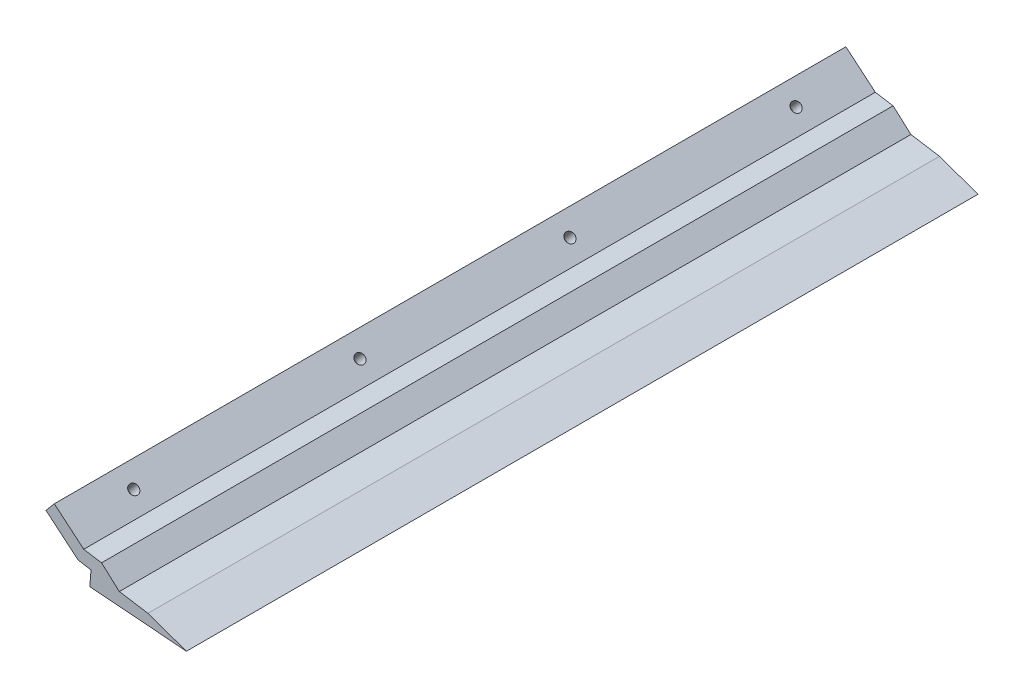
ISO-10303-21;
HEADER;
FILE_DESCRIPTION(('STEP AP214'),'2;1');
FILE_NAME('part.step','',(''),(''),'','','');
FILE_SCHEMA(('AUTOMOTIVE_DESIGN { 1 0 10303 214 1 1 1 1 }'));
ENDSEC;
DATA;
#1=APPLICATION_CONTEXT('core data for automotive mechanical design processes');
#2=APPLICATION_PROTOCOL_DEFINITION('international standard','automotive_design',2000,#1);
#3=PRODUCT_CONTEXT('',#1,'mechanical');
#4=PRODUCT('Part','Part','',(#3));
#5=PRODUCT_RELATED_PRODUCT_CATEGORY('part','',(#4));
#6=PRODUCT_DEFINITION_FORMATION('','',#4);
#7=PRODUCT_DEFINITION_CONTEXT('part definition',#1,'design');
#8=PRODUCT_DEFINITION('design','',#6,#7);
#9=PRODUCT_DEFINITION_SHAPE('','',#8);
#10=(LENGTH_UNIT() NAMED_UNIT(*) SI_UNIT(.MILLI.,.METRE.));
#11=(NAMED_UNIT(*) PLANE_ANGLE_UNIT() SI_UNIT($,.RADIAN.));
#12=(NAMED_UNIT(*) SI_UNIT($,.STERADIAN.) SOLID_ANGLE_UNIT());
#13=UNCERTAINTY_MEASURE_WITH_UNIT(LENGTH_MEASURE(1.E-05),#10,'distance_accuracy_value','');
#14=(GEOMETRIC_REPRESENTATION_CONTEXT(3) GLOBAL_UNCERTAINTY_ASSIGNED_CONTEXT((#13)) GLOBAL_UNIT_ASSIGNED_CONTEXT((#10,
#11,#12)) REPRESENTATION_CONTEXT('',''));
#15=CARTESIAN_POINT('',(0.,0.,0.));
#16=DIRECTION('',(0.,0.,1.));
#17=DIRECTION('',(1.,0.,0.));
#18=AXIS2_PLACEMENT_3D('',#15,#16,#17);
#19=CARTESIAN_POINT('',(0.,0.,245.));
#20=DIRECTION('',(0.,0.,-1.));
#21=DIRECTION('',(-1.,0.,0.));
#22=AXIS2_PLACEMENT_3D('',#19,#20,#21);
#23=PLANE('',#22);
#24=DIRECTION('',(0.0790333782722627,0.996871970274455,0.));
#25=VECTOR('',#24,1.);
#26=CARTESIAN_POINT('',(38.0749704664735,-3.01863592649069,245.));
#27=LINE('',#26,#25);
#28=CARTESIAN_POINT('',(38.5022683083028,2.37100134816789,245.));
#29=VERTEX_POINT('',#28);
#30=CARTESIAN_POINT('',(38.8721934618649,7.03697950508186,245.));
#31=VERTEX_POINT('',#30);
#32=EDGE_CURVE('E217',#29,#31,#27,.T.);
#33=ORIENTED_EDGE('',*,*,#32,.F.);
#34=DIRECTION('',(0.996871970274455,-0.079033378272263,0.));
#35=VECTOR('',#34,1.);
#36=CARTESIAN_POINT('',(32.9164336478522,2.81385398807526,245.));
#37=LINE('',#36,#35);
#38=CARTESIAN_POINT('',(68.4084274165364,0.,245.));
#39=VERTEX_POINT('',#38);
#40=EDGE_CURVE('E240',#29,#39,#37,.T.);
#41=ORIENTED_EDGE('',*,*,#40,.T.);
#42=DIRECTION('',(-0.942668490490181,0.333730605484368,0.));
#43=VECTOR('',#42,1.);
#44=CARTESIAN_POINT('',(56.5013619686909,4.21542907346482,245.));
#45=LINE('',#44,#43);
#46=CARTESIAN_POINT('',(56.5013619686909,4.21542907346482,245.));
#47=VERTEX_POINT('',#46);
#48=EDGE_CURVE('E227',#39,#47,#45,.T.);
#49=ORIENTED_EDGE('',*,*,#48,.T.);
#50=DIRECTION('',(-0.987432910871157,0.15803875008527,0.));
#51=VECTOR('',#50,1.);
#52=CARTESIAN_POINT('',(34.9055240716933,7.67184539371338,245.));
#53=LINE('',#52,#51);
#54=CARTESIAN_POINT('',(47.64506833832,5.63287987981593,245.));
#55=VERTEX_POINT('',#54);
#56=EDGE_CURVE('E228',#47,#55,#53,.T.);
#57=ORIENTED_EDGE('',*,*,#56,.T.);
#58=DIRECTION('',(-0.745290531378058,0.666739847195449,0.));
#59=VECTOR('',#58,1.);
#60=CARTESIAN_POINT('',(42.13028103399,10.5664303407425,245.));
#61=LINE('',#60,#59);
#62=CARTESIAN_POINT('',(42.13028103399,10.5664303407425,245.));
#63=VERTEX_POINT('',#62);
#64=EDGE_CURVE('E209',#55,#63,#61,.T.);
#65=ORIENTED_EDGE('',*,*,#64,.T.);
#66=DIRECTION('',(-0.987432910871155,0.158038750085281,0.));
#67=VECTOR('',#66,1.);
#68=CARTESIAN_POINT('',(36.629582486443,11.4468177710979,245.));
#69=LINE('',#68,#67);
#70=CARTESIAN_POINT('',(36.629582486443,11.4468177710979,245.));
#71=VERTEX_POINT('',#70);
#72=EDGE_CURVE('E210',#63,#71,#69,.T.);
#73=ORIENTED_EDGE('',*,*,#72,.T.);
#74=DIRECTION('',(-0.766044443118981,0.642787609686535,0.));
#75=VECTOR('',#74,1.);
#76=CARTESIAN_POINT('',(27.5180967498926,19.0922620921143,245.));
#77=LINE('',#76,#75);
#78=CARTESIAN_POINT('',(27.5180967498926,19.0922620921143,245.));
#79=VERTEX_POINT('',#78);
#80=EDGE_CURVE('E175',#71,#79,#77,.T.);
#81=ORIENTED_EDGE('',*,*,#80,.T.);
#82=DIRECTION('',(-0.642787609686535,-0.766044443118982,0.));
#83=VECTOR('',#82,1.);
#84=CARTESIAN_POINT('',(24.9469463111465,16.0280843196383,245.));
#85=LINE('',#84,#83);
#86=CARTESIAN_POINT('',(24.9469463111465,16.0280843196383,245.));
#87=VERTEX_POINT('',#86);
#88=EDGE_CURVE('E273',#79,#87,#85,.T.);
#89=ORIENTED_EDGE('',*,*,#88,.T.);
#90=DIRECTION('',(0.766044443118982,-0.642787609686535,0.));
#91=VECTOR('',#90,1.);
#92=CARTESIAN_POINT('',(34.9055240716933,7.67184539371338,245.));
#93=LINE('',#92,#91);
#94=CARTESIAN_POINT('',(34.9055240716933,7.67184539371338,245.));
#95=VERTEX_POINT('',#94);
#96=EDGE_CURVE('E268',#87,#95,#93,.T.);
#97=ORIENTED_EDGE('',*,*,#96,.T.);
#98=DIRECTION('',(0.987432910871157,-0.15803875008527,0.));
#99=VECTOR('',#98,1.);
#100=CARTESIAN_POINT('',(38.8721934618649,7.03697950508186,245.));
#101=LINE('',#100,#99);
#102=EDGE_CURVE('E258',#95,#31,#101,.T.);
#103=ORIENTED_EDGE('',*,*,#102,.T.);
#104=EDGE_LOOP('',(#33,#41,#49,#57,#65,#73,#81,#89,#97,#103));
#105=FACE_BOUND('',#104,.T.);
#106=ADVANCED_FACE('F91',(#105),#23,.F.);
#107=CARTESIAN_POINT('',(0.,0.,0.));
#108=DIRECTION('',(0.,0.,-1.));
#109=DIRECTION('',(-1.,0.,0.));
#110=AXIS2_PLACEMENT_3D('',#107,#108,#109);
#111=PLANE('',#110);
#112=DIRECTION('',(0.996871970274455,-0.079033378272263,0.));
#113=VECTOR('',#112,1.);
#114=CARTESIAN_POINT('',(32.9164336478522,2.81385398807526,0.));
#115=LINE('',#114,#113);
#116=CARTESIAN_POINT('',(38.5022683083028,2.37100134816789,0.));
#117=VERTEX_POINT('',#116);
#118=CARTESIAN_POINT('',(68.4084274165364,0.,0.));
#119=VERTEX_POINT('',#118);
#120=EDGE_CURVE('E238',#117,#119,#115,.T.);
#121=ORIENTED_EDGE('',*,*,#120,.F.);
#122=DIRECTION('',(0.0790333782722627,0.996871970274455,0.));
#123=VECTOR('',#122,1.);
#124=CARTESIAN_POINT('',(38.0749704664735,-3.01863592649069,0.));
#125=LINE('',#124,#123);
#126=CARTESIAN_POINT('',(38.8721934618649,7.03697950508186,0.));
#127=VERTEX_POINT('',#126);
#128=EDGE_CURVE('E213',#117,#127,#125,.T.);
#129=ORIENTED_EDGE('',*,*,#128,.T.);
#130=DIRECTION('',(-0.987432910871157,0.15803875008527,0.));
#131=VECTOR('',#130,1.);
#132=CARTESIAN_POINT('',(38.8721934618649,7.03697950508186,0.));
#133=LINE('',#132,#131);
#134=CARTESIAN_POINT('',(34.9055240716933,7.67184539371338,0.));
#135=VERTEX_POINT('',#134);
#136=EDGE_CURVE('E203',#127,#135,#133,.T.);
#137=ORIENTED_EDGE('',*,*,#136,.T.);
#138=DIRECTION('',(-0.766044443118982,0.642787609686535,0.));
#139=VECTOR('',#138,1.);
#140=CARTESIAN_POINT('',(34.9055240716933,7.67184539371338,0.));
#141=LINE('',#140,#139);
#142=CARTESIAN_POINT('',(24.9469463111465,16.0280843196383,0.));
#143=VERTEX_POINT('',#142);
#144=EDGE_CURVE('E206',#135,#143,#141,.T.);
#145=ORIENTED_EDGE('',*,*,#144,.T.);
#146=DIRECTION('',(0.642787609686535,0.766044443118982,0.));
#147=VECTOR('',#146,1.);
#148=CARTESIAN_POINT('',(24.9469463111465,16.0280843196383,0.));
#149=LINE('',#148,#147);
#150=CARTESIAN_POINT('',(27.5180967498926,19.0922620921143,0.));
#151=VERTEX_POINT('',#150);
#152=EDGE_CURVE('E193',#143,#151,#149,.T.);
#153=ORIENTED_EDGE('',*,*,#152,.T.);
#154=DIRECTION('',(0.766044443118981,-0.642787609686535,0.));
#155=VECTOR('',#154,1.);
#156=CARTESIAN_POINT('',(27.5180967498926,19.0922620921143,0.));
#157=LINE('',#156,#155);
#158=CARTESIAN_POINT('',(36.629582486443,11.4468177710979,0.));
#159=VERTEX_POINT('',#158);
#160=EDGE_CURVE('E172',#151,#159,#157,.T.);
#161=ORIENTED_EDGE('',*,*,#160,.T.);
#162=DIRECTION('',(0.987432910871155,-0.158038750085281,0.));
#163=VECTOR('',#162,1.);
#164=CARTESIAN_POINT('',(36.629582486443,11.4468177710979,0.));
#165=LINE('',#164,#163);
#166=CARTESIAN_POINT('',(42.13028103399,10.5664303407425,0.));
#167=VERTEX_POINT('',#166);
#168=EDGE_CURVE('E183',#159,#167,#165,.T.);
#169=ORIENTED_EDGE('',*,*,#168,.T.);
#170=DIRECTION('',(0.745290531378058,-0.666739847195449,0.));
#171=VECTOR('',#170,1.);
#172=CARTESIAN_POINT('',(42.13028103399,10.5664303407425,0.));
#173=LINE('',#172,#171);
#174=CARTESIAN_POINT('',(47.64506833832,5.63287987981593,0.));
#175=VERTEX_POINT('',#174);
#176=EDGE_CURVE('E187',#167,#175,#173,.T.);
#177=ORIENTED_EDGE('',*,*,#176,.T.);
#178=DIRECTION('',(-0.987432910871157,0.15803875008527,0.));
#179=VECTOR('',#178,1.);
#180=CARTESIAN_POINT('',(34.9055240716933,7.67184539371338,0.));
#181=LINE('',#180,#179);
#182=CARTESIAN_POINT('',(56.5013619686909,4.21542907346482,0.));
#183=VERTEX_POINT('',#182);
#184=EDGE_CURVE('E236',#183,#175,#181,.T.);
#185=ORIENTED_EDGE('',*,*,#184,.F.);
#186=DIRECTION('',(-0.942668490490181,0.333730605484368,0.));
#187=VECTOR('',#186,1.);
#188=CARTESIAN_POINT('',(56.5013619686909,4.21542907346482,0.));
#189=LINE('',#188,#187);
#190=EDGE_CURVE('E230',#119,#183,#189,.T.);
#191=ORIENTED_EDGE('',*,*,#190,.F.);
#192=EDGE_LOOP('',(#121,#129,#137,#145,#153,#161,#169,#177,#185,#191));
#193=FACE_BOUND('',#192,.T.);
#194=ADVANCED_FACE('F190',(#193),#111,.T.);
#195=CARTESIAN_POINT('',(32.9164336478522,2.81385398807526,245.));
#196=DIRECTION('',(0.079033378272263,0.996871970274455,0.));
#197=DIRECTION('',(-0.996871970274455,0.079033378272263,0.));
#198=AXIS2_PLACEMENT_3D('',#195,#196,#197);
#199=PLANE('',#198);
#200=DIRECTION('',(0.,0.,-1.));
#201=VECTOR('',#200,1.);
#202=CARTESIAN_POINT('',(38.5022683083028,2.37100134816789,274.));
#203=LINE('',#202,#201);
#204=EDGE_CURVE('E220',#29,#117,#203,.T.);
#205=ORIENTED_EDGE('',*,*,#204,.T.);
#206=ORIENTED_EDGE('',*,*,#120,.T.);
#207=DIRECTION('',(0.,0.,-1.));
#208=VECTOR('',#207,1.);
#209=CARTESIAN_POINT('',(68.4084274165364,0.,245.));
#210=LINE('',#209,#208);
#211=EDGE_CURVE('E99',#39,#119,#210,.T.);
#212=ORIENTED_EDGE('',*,*,#211,.F.);
#213=ORIENTED_EDGE('',*,*,#40,.F.);
#214=EDGE_LOOP('',(#205,#206,#212,#213));
#215=FACE_BOUND('',#214,.T.);
#216=ADVANCED_FACE('F93',(#215),#199,.F.);
#217=CARTESIAN_POINT('',(34.9055240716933,7.67184539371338,-34.3700704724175));
#218=DIRECTION('',(0.15803875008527,0.987432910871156,0.));
#219=DIRECTION('',(-0.987432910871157,0.15803875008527,0.));
#220=AXIS2_PLACEMENT_3D('',#217,#218,#219);
#221=PLANE('',#220);
#222=DIRECTION('',(0.,0.,-1.));
#223=VECTOR('',#222,1.);
#224=CARTESIAN_POINT('',(47.64506833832,5.63287987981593,274.));
#225=LINE('',#224,#223);
#226=EDGE_CURVE('E106',#55,#175,#225,.T.);
#227=ORIENTED_EDGE('',*,*,#226,.F.);
#228=ORIENTED_EDGE('',*,*,#56,.F.);
#229=DIRECTION('',(0.,0.,1.));
#230=VECTOR('',#229,1.);
#231=CARTESIAN_POINT('',(56.5013619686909,4.21542907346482,-34.3700704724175));
#232=LINE('',#231,#230);
#233=EDGE_CURVE('E235',#183,#47,#232,.T.);
#234=ORIENTED_EDGE('',*,*,#233,.F.);
#235=ORIENTED_EDGE('',*,*,#184,.T.);
#236=EDGE_LOOP('',(#227,#228,#234,#235));
#237=FACE_BOUND('',#236,.T.);
#238=ADVANCED_FACE('F251',(#237),#221,.T.);
#239=CARTESIAN_POINT('',(56.5013619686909,4.21542907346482,-34.3700704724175));
#240=DIRECTION('',(0.333730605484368,0.942668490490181,0.));
#241=DIRECTION('',(-0.942668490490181,0.333730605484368,0.));
#242=AXIS2_PLACEMENT_3D('',#239,#240,#241);
#243=PLANE('',#242);
#244=ORIENTED_EDGE('',*,*,#211,.T.);
#245=ORIENTED_EDGE('',*,*,#190,.T.);
#246=ORIENTED_EDGE('',*,*,#233,.T.);
#247=ORIENTED_EDGE('',*,*,#48,.F.);
#248=EDGE_LOOP('',(#244,#245,#246,#247));
#249=FACE_BOUND('',#248,.T.);
#250=ADVANCED_FACE('F246',(#249),#243,.T.);
#251=CARTESIAN_POINT('',(2.70117587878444,16.877063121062,274.));
#252=DIRECTION('',(0.158038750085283,0.987432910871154,0.));
#253=DIRECTION('',(-0.987432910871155,0.158038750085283,0.));
#254=AXIS2_PLACEMENT_3D('',#251,#252,#253);
#255=PLANE('',#254);
#256=DIRECTION('',(0.,0.,-1.));
#257=VECTOR('',#256,1.);
#258=CARTESIAN_POINT('',(36.6295824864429,11.4468177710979,274.));
#259=LINE('',#258,#257);
#260=EDGE_CURVE('E168',#71,#159,#259,.T.);
#261=ORIENTED_EDGE('',*,*,#260,.F.);
#262=ORIENTED_EDGE('',*,*,#72,.F.);
#263=DIRECTION('',(0.,0.,-1.));
#264=VECTOR('',#263,1.);
#265=CARTESIAN_POINT('',(42.13028103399,10.5664303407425,274.));
#266=LINE('',#265,#264);
#267=EDGE_CURVE('E180',#63,#167,#266,.T.);
#268=ORIENTED_EDGE('',*,*,#267,.T.);
#269=ORIENTED_EDGE('',*,*,#168,.F.);
#270=EDGE_LOOP('',(#261,#262,#268,#269));
#271=FACE_BOUND('',#270,.T.);
#272=ADVANCED_FACE('F184',(#271),#255,.T.);
#273=CARTESIAN_POINT('',(20.7709185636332,24.7538168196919,274.));
#274=DIRECTION('',(0.642787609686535,0.766044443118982,0.));
#275=DIRECTION('',(-0.766044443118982,0.642787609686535,0.));
#276=AXIS2_PLACEMENT_3D('',#273,#274,#275);
#277=PLANE('',#276);
#278=CARTESIAN_POINT('',(32.1143634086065,15.2355364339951,155.));
#279=DIRECTION('',(0.642787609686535,0.766044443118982,0.));
#280=DIRECTION('',(-0.766044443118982,0.642787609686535,0.));
#281=AXIS2_PLACEMENT_3D('',#278,#279,#280);
#282=CIRCLE('',#281,1.5);
#283=CARTESIAN_POINT('',(30.9652967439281,16.1997178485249,155.));
#284=VERTEX_POINT('',#283);
#285=EDGE_CURVE('E280',#284,#284,#282,.F.);
#286=ORIENTED_EDGE('',*,*,#285,.T.);
#287=EDGE_LOOP('',(#286));
#288=FACE_BOUND('',#287,.T.);
#289=CARTESIAN_POINT('',(32.1143634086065,15.2355364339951,90.));
#290=DIRECTION('',(0.642787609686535,0.766044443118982,0.));
#291=DIRECTION('',(-0.766044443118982,0.642787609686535,0.));
#292=AXIS2_PLACEMENT_3D('',#289,#290,#291);
#293=CIRCLE('',#292,1.5);
#294=CARTESIAN_POINT('',(30.9652967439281,16.1997178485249,90.));
#295=VERTEX_POINT('',#294);
#296=EDGE_CURVE('E283',#295,#295,#293,.F.);
#297=ORIENTED_EDGE('',*,*,#296,.T.);
#298=EDGE_LOOP('',(#297));
#299=FACE_BOUND('',#298,.T.);
#300=CARTESIAN_POINT('',(32.1143634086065,15.2355364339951,20.));
#301=DIRECTION('',(0.642787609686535,0.766044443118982,0.));
#302=DIRECTION('',(-0.766044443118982,0.642787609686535,0.));
#303=AXIS2_PLACEMENT_3D('',#300,#301,#302);
#304=CIRCLE('',#303,1.5);
#305=CARTESIAN_POINT('',(30.9652967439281,16.1997178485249,20.));
#306=VERTEX_POINT('',#305);
#307=EDGE_CURVE('E286',#306,#306,#304,.F.);
#308=ORIENTED_EDGE('',*,*,#307,.T.);
#309=EDGE_LOOP('',(#308));
#310=FACE_BOUND('',#309,.T.);
#311=CARTESIAN_POINT('',(32.1143634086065,15.2355364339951,225.));
#312=DIRECTION('',(0.642787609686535,0.766044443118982,0.));
#313=DIRECTION('',(-0.766044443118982,0.642787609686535,0.));
#314=AXIS2_PLACEMENT_3D('',#311,#312,#313);
#315=CIRCLE('',#314,1.5);
#316=CARTESIAN_POINT('',(30.9652967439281,16.1997178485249,225.));
#317=VERTEX_POINT('',#316);
#318=EDGE_CURVE('E194',#317,#317,#315,.F.);
#319=ORIENTED_EDGE('',*,*,#318,.T.);
#320=EDGE_LOOP('',(#319));
#321=FACE_BOUND('',#320,.T.);
#322=DIRECTION('',(0.,0.,-1.));
#323=VECTOR('',#322,1.);
#324=CARTESIAN_POINT('',(27.5180967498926,19.0922620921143,274.));
#325=LINE('',#324,#323);
#326=EDGE_CURVE('E179',#79,#151,#325,.T.);
#327=ORIENTED_EDGE('',*,*,#326,.F.);
#328=ORIENTED_EDGE('',*,*,#80,.F.);
#329=ORIENTED_EDGE('',*,*,#260,.T.);
#330=ORIENTED_EDGE('',*,*,#160,.F.);
#331=EDGE_LOOP('',(#327,#328,#329,#330));
#332=FACE_BOUND('',#331,.T.);
#333=ADVANCED_FACE('F170',(#288,#299,#310,#321,#332),#277,.T.);
#334=CARTESIAN_POINT('',(38.0749704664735,-3.01863592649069,274.));
#335=DIRECTION('',(-0.996871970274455,0.0790333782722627,0.));
#336=DIRECTION('',(-0.0790333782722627,-0.996871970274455,0.));
#337=AXIS2_PLACEMENT_3D('',#334,#335,#336);
#338=PLANE('',#337);
#339=ORIENTED_EDGE('',*,*,#32,.T.);
#340=DIRECTION('',(0.,0.,1.));
#341=VECTOR('',#340,1.);
#342=CARTESIAN_POINT('',(38.8721934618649,7.03697950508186,-34.3700704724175));
#343=LINE('',#342,#341);
#344=EDGE_CURVE('E12',#127,#31,#343,.T.);
#345=ORIENTED_EDGE('',*,*,#344,.F.);
#346=ORIENTED_EDGE('',*,*,#128,.F.);
#347=ORIENTED_EDGE('',*,*,#204,.F.);
#348=EDGE_LOOP('',(#339,#345,#346,#347));
#349=FACE_BOUND('',#348,.T.);
#350=ADVANCED_FACE('F260',(#349),#338,.T.);
#351=CARTESIAN_POINT('',(18.199768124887,21.689639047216,274.));
#352=DIRECTION('',(0.642787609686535,0.766044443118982,0.));
#353=DIRECTION('',(-0.766044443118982,0.642787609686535,0.));
#354=AXIS2_PLACEMENT_3D('',#351,#352,#353);
#355=PLANE('',#354);
#356=CARTESIAN_POINT('',(29.5432129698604,12.1713586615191,155.));
#357=DIRECTION('',(0.642787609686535,0.766044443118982,0.));
#358=DIRECTION('',(-0.766044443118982,0.642787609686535,0.));
#359=AXIS2_PLACEMENT_3D('',#356,#357,#358);
#360=CIRCLE('',#359,1.5);
#361=CARTESIAN_POINT('',(28.3941463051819,13.1355400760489,155.));
#362=VERTEX_POINT('',#361);
#363=EDGE_CURVE('E289',#362,#362,#360,.T.);
#364=ORIENTED_EDGE('',*,*,#363,.T.);
#365=EDGE_LOOP('',(#364));
#366=FACE_BOUND('',#365,.T.);
#367=CARTESIAN_POINT('',(29.5432129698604,12.1713586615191,90.));
#368=DIRECTION('',(0.642787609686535,0.766044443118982,0.));
#369=DIRECTION('',(0.766044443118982,-0.642787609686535,0.));
#370=AXIS2_PLACEMENT_3D('',#367,#368,#369);
#371=CIRCLE('',#370,1.5);
#372=CARTESIAN_POINT('',(30.6922796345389,11.2071772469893,90.));
#373=VERTEX_POINT('',#372);
#374=EDGE_CURVE('E293',#373,#373,#371,.T.);
#375=ORIENTED_EDGE('',*,*,#374,.T.);
#376=EDGE_LOOP('',(#375));
#377=FACE_BOUND('',#376,.T.);
#378=CARTESIAN_POINT('',(29.5432129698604,12.1713586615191,20.));
#379=DIRECTION('',(0.642787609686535,0.766044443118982,0.));
#380=DIRECTION('',(0.766044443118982,-0.642787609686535,0.));
#381=AXIS2_PLACEMENT_3D('',#378,#379,#380);
#382=CIRCLE('',#381,1.5);
#383=CARTESIAN_POINT('',(30.6922796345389,11.2071772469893,20.));
#384=VERTEX_POINT('',#383);
#385=EDGE_CURVE('E290',#384,#384,#382,.T.);
#386=ORIENTED_EDGE('',*,*,#385,.T.);
#387=EDGE_LOOP('',(#386));
#388=FACE_BOUND('',#387,.T.);
#389=CARTESIAN_POINT('',(29.5432129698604,12.1713586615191,225.));
#390=DIRECTION('',(0.642787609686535,0.766044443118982,0.));
#391=DIRECTION('',(-0.766044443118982,0.642787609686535,0.));
#392=AXIS2_PLACEMENT_3D('',#389,#390,#391);
#393=CIRCLE('',#392,1.5);
#394=CARTESIAN_POINT('',(28.3941463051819,13.1355400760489,225.));
#395=VERTEX_POINT('',#394);
#396=EDGE_CURVE('E197',#395,#395,#393,.T.);
#397=ORIENTED_EDGE('',*,*,#396,.T.);
#398=EDGE_LOOP('',(#397));
#399=FACE_BOUND('',#398,.T.);
#400=DIRECTION('',(0.,0.,-1.));
#401=VECTOR('',#400,1.);
#402=CARTESIAN_POINT('',(24.9469463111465,16.0280843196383,274.));
#403=LINE('',#402,#401);
#404=EDGE_CURVE('E216',#87,#143,#403,.T.);
#405=ORIENTED_EDGE('',*,*,#404,.T.);
#406=ORIENTED_EDGE('',*,*,#144,.F.);
#407=DIRECTION('',(0.,0.,-1.));
#408=VECTOR('',#407,1.);
#409=CARTESIAN_POINT('',(34.9055240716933,7.67184539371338,274.));
#410=LINE('',#409,#408);
#411=EDGE_CURVE('E223',#95,#135,#410,.T.);
#412=ORIENTED_EDGE('',*,*,#411,.F.);
#413=ORIENTED_EDGE('',*,*,#96,.F.);
#414=EDGE_LOOP('',(#405,#406,#412,#413));
#415=FACE_BOUND('',#414,.T.);
#416=ADVANCED_FACE('F266',(#366,#377,#388,#399,#415),#355,.F.);
#417=CARTESIAN_POINT('',(2.06902087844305,12.9273314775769,274.));
#418=DIRECTION('',(0.15803875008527,0.987432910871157,0.));
#419=DIRECTION('',(-0.987432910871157,0.15803875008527,0.));
#420=AXIS2_PLACEMENT_3D('',#417,#418,#419);
#421=PLANE('',#420);
#422=ORIENTED_EDGE('',*,*,#411,.T.);
#423=ORIENTED_EDGE('',*,*,#136,.F.);
#424=ORIENTED_EDGE('',*,*,#344,.T.);
#425=ORIENTED_EDGE('',*,*,#102,.F.);
#426=EDGE_LOOP('',(#422,#423,#424,#425));
#427=FACE_BOUND('',#426,.T.);
#428=ADVANCED_FACE('F263',(#427),#421,.F.);
#429=CARTESIAN_POINT('',(6.74717818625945,-5.66155472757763,274.));
#430=DIRECTION('',(-0.766044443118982,0.642787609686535,0.));
#431=DIRECTION('',(-0.642787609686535,-0.766044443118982,0.));
#432=AXIS2_PLACEMENT_3D('',#429,#430,#431);
#433=PLANE('',#432);
#434=ORIENTED_EDGE('',*,*,#404,.F.);
#435=ORIENTED_EDGE('',*,*,#88,.F.);
#436=ORIENTED_EDGE('',*,*,#326,.T.);
#437=ORIENTED_EDGE('',*,*,#152,.F.);
#438=EDGE_LOOP('',(#434,#435,#436,#437));
#439=FACE_BOUND('',#438,.T.);
#440=ADVANCED_FACE('F272',(#439),#433,.T.);
#441=CARTESIAN_POINT('',(23.9792970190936,26.8043721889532,274.));
#442=DIRECTION('',(0.666739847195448,0.74529053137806,0.));
#443=DIRECTION('',(-0.74529053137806,0.666739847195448,0.));
#444=AXIS2_PLACEMENT_3D('',#441,#442,#443);
#445=PLANE('',#444);
#446=ORIENTED_EDGE('',*,*,#267,.F.);
#447=ORIENTED_EDGE('',*,*,#64,.F.);
#448=ORIENTED_EDGE('',*,*,#226,.T.);
#449=ORIENTED_EDGE('',*,*,#176,.F.);
#450=EDGE_LOOP('',(#446,#447,#448,#449));
#451=FACE_BOUND('',#450,.T.);
#452=ADVANCED_FACE('F326',(#451),#445,.T.);
#453=CARTESIAN_POINT('',(205.667018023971,222.06753607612,225.));
#454=DIRECTION('',(-0.642787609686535,-0.766044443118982,0.));
#455=DIRECTION('',(0.766044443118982,-0.642787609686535,0.));
#456=AXIS2_PLACEMENT_3D('',#453,#454,#455);
#457=CYLINDRICAL_SURFACE('',#456,1.5);
#458=ORIENTED_EDGE('',*,*,#318,.F.);
#459=EDGE_LOOP('',(#458));
#460=FACE_BOUND('',#459,.T.);
#461=ORIENTED_EDGE('',*,*,#396,.F.);
#462=EDGE_LOOP('',(#461));
#463=FACE_BOUND('',#462,.T.);
#464=ADVANCED_FACE('F340',(#460,#463),#457,.F.);
#465=CARTESIAN_POINT('',(205.667018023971,222.06753607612,20.));
#466=DIRECTION('',(-0.642787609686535,-0.766044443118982,0.));
#467=DIRECTION('',(0.766044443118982,-0.642787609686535,0.));
#468=AXIS2_PLACEMENT_3D('',#465,#466,#467);
#469=CYLINDRICAL_SURFACE('',#468,1.5);
#470=ORIENTED_EDGE('',*,*,#307,.F.);
#471=EDGE_LOOP('',(#470));
#472=FACE_BOUND('',#471,.T.);
#473=ORIENTED_EDGE('',*,*,#385,.F.);
#474=EDGE_LOOP('',(#473));
#475=FACE_BOUND('',#474,.T.);
#476=ADVANCED_FACE('F309',(#472,#475),#469,.F.);
#477=CARTESIAN_POINT('',(205.667018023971,222.06753607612,90.));
#478=DIRECTION('',(-0.642787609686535,-0.766044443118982,0.));
#479=DIRECTION('',(0.766044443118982,-0.642787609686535,0.));
#480=AXIS2_PLACEMENT_3D('',#477,#478,#479);
#481=CYLINDRICAL_SURFACE('',#480,1.5);
#482=ORIENTED_EDGE('',*,*,#296,.F.);
#483=EDGE_LOOP('',(#482));
#484=FACE_BOUND('',#483,.T.);
#485=ORIENTED_EDGE('',*,*,#374,.F.);
#486=EDGE_LOOP('',(#485));
#487=FACE_BOUND('',#486,.T.);
#488=ADVANCED_FACE('F303',(#484,#487),#481,.F.);
#489=CARTESIAN_POINT('',(205.667018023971,222.06753607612,155.));
#490=DIRECTION('',(-0.642787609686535,-0.766044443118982,0.));
#491=DIRECTION('',(0.766044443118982,-0.642787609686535,0.));
#492=AXIS2_PLACEMENT_3D('',#489,#490,#491);
#493=CYLINDRICAL_SURFACE('',#492,1.5);
#494=ORIENTED_EDGE('',*,*,#285,.F.);
#495=EDGE_LOOP('',(#494));
#496=FACE_BOUND('',#495,.T.);
#497=ORIENTED_EDGE('',*,*,#363,.F.);
#498=EDGE_LOOP('',(#497));
#499=FACE_BOUND('',#498,.T.);
#500=ADVANCED_FACE('F301',(#496,#499),#493,.F.);
#501=CLOSED_SHELL('',(#106,#194,#216,#238,#250,#272,#333,#350,#416,#428,#440,#452,#464,#476,
#488,#500));
#502=MANIFOLD_SOLID_BREP('B2',#501);
#503=ADVANCED_BREP_SHAPE_REPRESENTATION('',(#18,#502),#14);
#504=SHAPE_DEFINITION_REPRESENTATION(#9,#503);
ENDSEC;
END-ISO-10303-21;
